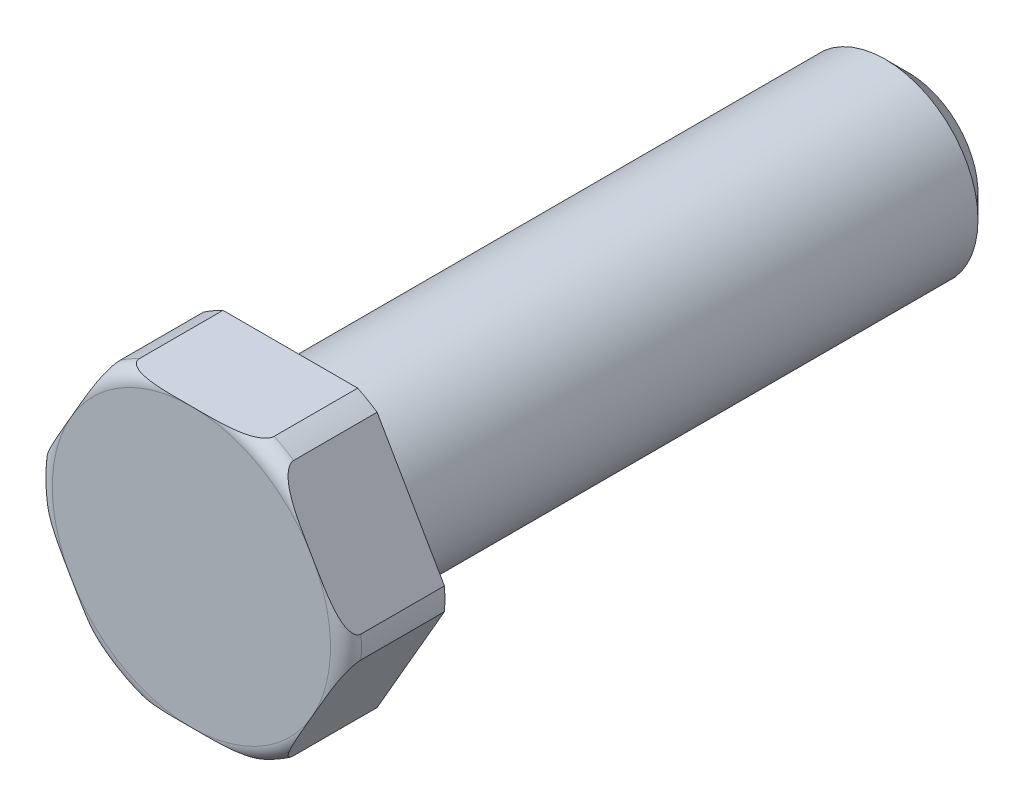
from build123d import *

# Parameters (mm, degrees)
ESQUISSE1_R             = 10
EXTRUSION1_DEPTH        = 6.4
CONG_1_R                = 1
ESQUISSE2_R             = 14.142135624
ENL_V_MAT_EXTRU_1_DEPTH = 16.52288633
ESQUISSE3_R             = 6
EXTRUSION2_DEPTH        = 40
CHANFREIN1_SIZE         = 1.5


with BuildPart() as part:
    # Esquisse1 → Extrusion1 (new body)
    with BuildSketch(Plane.XY):
        Circle(ESQUISSE1_R)
    extrude(amount=EXTRUSION1_DEPTH)

    # Cong_1
    cong_1_edges = [part.edges().sort_by_distance(p)[0] for p in [
        (-10, 0, 6.4),
    ]]
    fillet(cong_1_edges, radius=CONG_1_R)

    # Esquisse2 → Enl_v. mat.-Extru.1 (cut, through all)
    with BuildSketch(Plane.XY.offset(6.4)):
        Circle(ESQUISSE2_R)
        Polygon((10.392304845, 0), (5.196152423, 9), (-5.196152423, 9), (-10.392304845, 0), (-5.196152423, -9), (5.196152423, -9), align=None, mode=Mode.SUBTRACT)
    extrude(amount=-ENL_V_MAT_EXTRU_1_DEPTH, mode=Mode.SUBTRACT)

    # Esquisse3 → Extrusion2 (add)
    with BuildSketch(Plane(origin=(0, 0, 0), x_dir=(-1, 0, 0), z_dir=(0, 0, -1))):
        with Locations(Location((0, 0, 0), (0, 0, 180))):
            Circle(ESQUISSE3_R)
    extrude(amount=EXTRUSION2_DEPTH)

    # Chanfrein1
    chanfrein1_edges = [part.edges().sort_by_distance(p)[0] for p in [
        (-6, 0, -40),
    ]]
    chamfer(chanfrein1_edges, length=CHANFREIN1_SIZE)


solid = part.part
